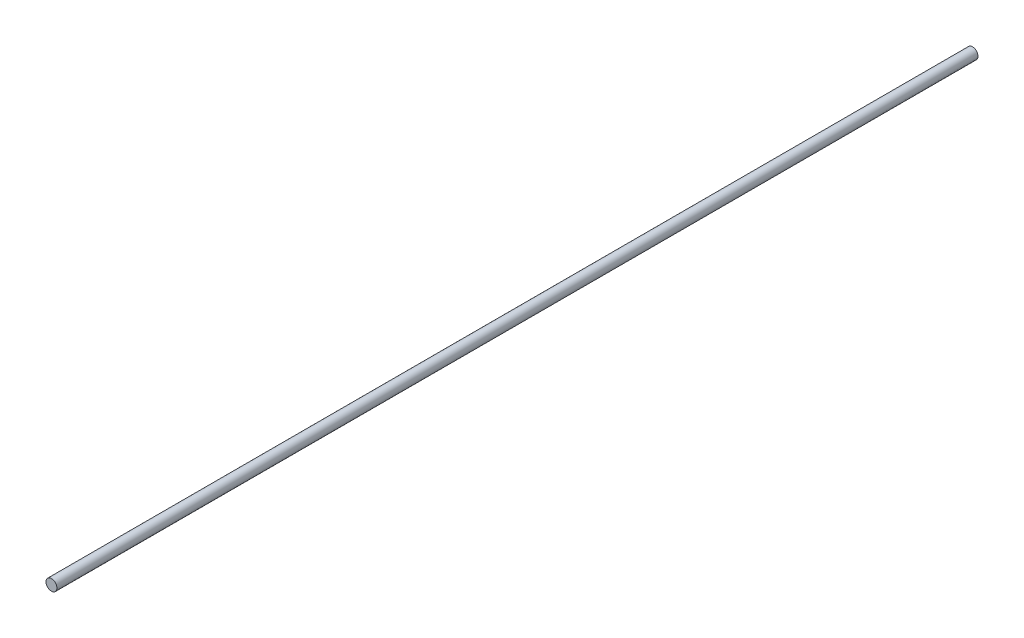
from build123d import *

# Parameters (mm, degrees)
SKETCH1_R           = 30
BOSS_EXTRUDE1_DEPTH = 5050


with BuildPart() as part:
    # Sketch1 → Boss-Extrude1 (new body)
    with BuildSketch(Plane.XY):
        Circle(SKETCH1_R)
    extrude(amount=-BOSS_EXTRUDE1_DEPTH)


solid = part.part
